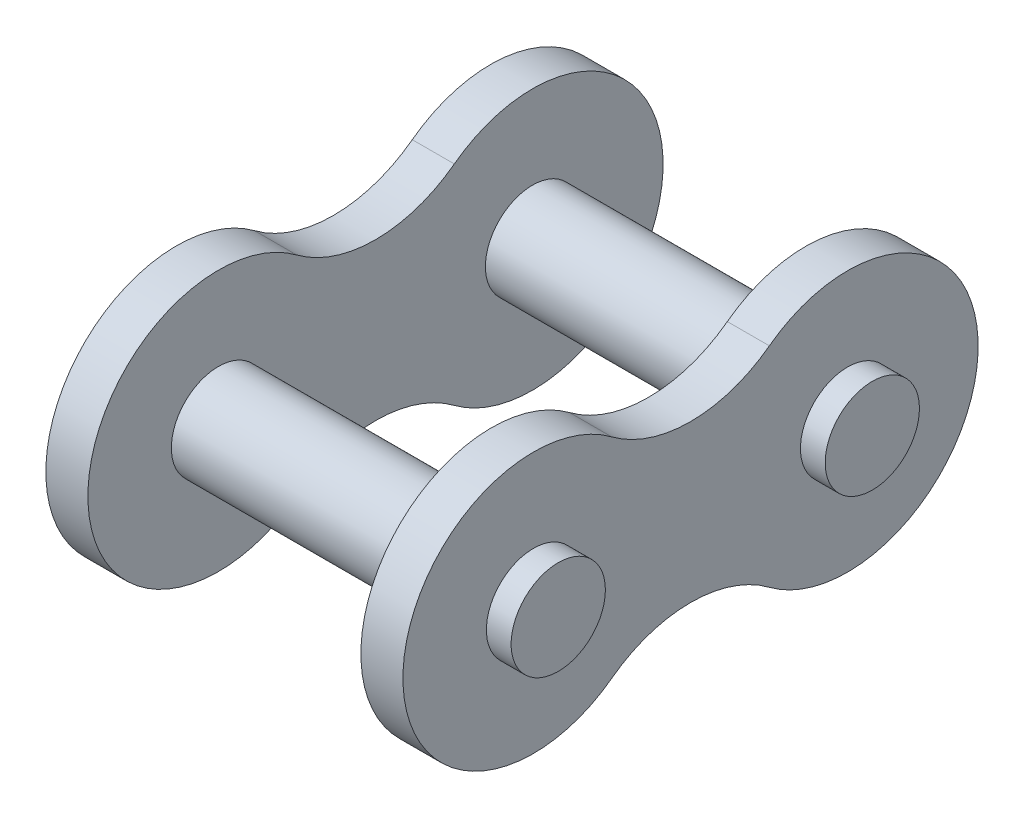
ISO-10303-21;
HEADER;
FILE_DESCRIPTION(('STEP AP214'),'2;1');
FILE_NAME('part.step','',(''),(''),'','','');
FILE_SCHEMA(('AUTOMOTIVE_DESIGN { 1 0 10303 214 1 1 1 1 }'));
ENDSEC;
DATA;
#1=APPLICATION_CONTEXT('core data for automotive mechanical design processes');
#2=APPLICATION_PROTOCOL_DEFINITION('international standard','automotive_design',2000,#1);
#3=PRODUCT_CONTEXT('',#1,'mechanical');
#4=PRODUCT('Part','Part','',(#3));
#5=PRODUCT_RELATED_PRODUCT_CATEGORY('part','',(#4));
#6=PRODUCT_DEFINITION_FORMATION('','',#4);
#7=PRODUCT_DEFINITION_CONTEXT('part definition',#1,'design');
#8=PRODUCT_DEFINITION('design','',#6,#7);
#9=PRODUCT_DEFINITION_SHAPE('','',#8);
#10=(LENGTH_UNIT() NAMED_UNIT(*) SI_UNIT(.MILLI.,.METRE.));
#11=(NAMED_UNIT(*) PLANE_ANGLE_UNIT() SI_UNIT($,.RADIAN.));
#12=(NAMED_UNIT(*) SI_UNIT($,.STERADIAN.) SOLID_ANGLE_UNIT());
#13=UNCERTAINTY_MEASURE_WITH_UNIT(LENGTH_MEASURE(1.E-05),#10,'distance_accuracy_value','');
#14=(GEOMETRIC_REPRESENTATION_CONTEXT(3) GLOBAL_UNCERTAINTY_ASSIGNED_CONTEXT((#13)) GLOBAL_UNIT_ASSIGNED_CONTEXT((#10,
#11,#12)) REPRESENTATION_CONTEXT('',''));
#15=CARTESIAN_POINT('',(0.,0.,0.));
#16=DIRECTION('',(0.,0.,1.));
#17=DIRECTION('',(1.,0.,0.));
#18=AXIS2_PLACEMENT_3D('',#15,#16,#17);
#19=CARTESIAN_POINT('',(-2.5,0.,0.));
#20=DIRECTION('',(1.,0.,0.));
#21=DIRECTION('',(0.,0.,-1.));
#22=AXIS2_PLACEMENT_3D('',#19,#20,#21);
#23=CYLINDRICAL_SURFACE('',#22,4.765);
#24=CARTESIAN_POINT('',(4.25,0.,0.));
#25=DIRECTION('',(1.,0.,0.));
#26=DIRECTION('',(0.,0.,-1.));
#27=AXIS2_PLACEMENT_3D('',#24,#25,#26);
#28=CIRCLE('',#27,4.765);
#29=CARTESIAN_POINT('',(4.25,0.,-4.765));
#30=VERTEX_POINT('',#29);
#31=EDGE_CURVE('E176',#30,#30,#28,.T.);
#32=ORIENTED_EDGE('',*,*,#31,.T.);
#33=EDGE_LOOP('',(#32));
#34=FACE_BOUND('',#33,.T.);
#35=CARTESIAN_POINT('',(31.85,0.,0.));
#36=DIRECTION('',(1.,0.,0.));
#37=DIRECTION('',(0.,0.,-1.));
#38=AXIS2_PLACEMENT_3D('',#35,#36,#37);
#39=CIRCLE('',#38,4.765);
#40=CARTESIAN_POINT('',(31.85,0.,-4.765));
#41=VERTEX_POINT('',#40);
#42=EDGE_CURVE('E155',#41,#41,#39,.F.);
#43=ORIENTED_EDGE('',*,*,#42,.T.);
#44=EDGE_LOOP('',(#43));
#45=FACE_BOUND('',#44,.T.);
#46=ADVANCED_FACE('F35',(#34,#45),#23,.T.);
#47=CARTESIAN_POINT('',(-2.5,0.,-31.75));
#48=DIRECTION('',(1.,0.,0.));
#49=DIRECTION('',(0.,0.,-1.));
#50=AXIS2_PLACEMENT_3D('',#47,#48,#49);
#51=CYLINDRICAL_SURFACE('',#50,4.765);
#52=CARTESIAN_POINT('',(4.25,0.,-31.75));
#53=DIRECTION('',(1.,0.,0.));
#54=DIRECTION('',(0.,0.,-1.));
#55=AXIS2_PLACEMENT_3D('',#52,#53,#54);
#56=CIRCLE('',#55,4.765);
#57=CARTESIAN_POINT('',(4.25,0.,-36.515));
#58=VERTEX_POINT('',#57);
#59=EDGE_CURVE('E179',#58,#58,#56,.T.);
#60=ORIENTED_EDGE('',*,*,#59,.T.);
#61=EDGE_LOOP('',(#60));
#62=FACE_BOUND('',#61,.T.);
#63=CARTESIAN_POINT('',(31.85,0.,-31.75));
#64=DIRECTION('',(1.,0.,0.));
#65=DIRECTION('',(0.,0.,-1.));
#66=AXIS2_PLACEMENT_3D('',#63,#64,#65);
#67=CIRCLE('',#66,4.765);
#68=CARTESIAN_POINT('',(31.85,0.,-36.515));
#69=VERTEX_POINT('',#68);
#70=EDGE_CURVE('E39',#69,#69,#67,.F.);
#71=ORIENTED_EDGE('',*,*,#70,.T.);
#72=EDGE_LOOP('',(#71));
#73=FACE_BOUND('',#72,.T.);
#74=ADVANCED_FACE('F214',(#62,#73),#51,.T.);
#75=CARTESIAN_POINT('',(4.25,10.6125580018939,-23.8125));
#76=DIRECTION('',(1.,0.,0.));
#77=DIRECTION('',(0.,0.,-1.));
#78=AXIS2_PLACEMENT_3D('',#75,#76,#77);
#79=PLANE('',#78);
#80=ORIENTED_EDGE('',*,*,#59,.F.);
#81=EDGE_LOOP('',(#80));
#82=FACE_BOUND('',#81,.T.);
#83=CARTESIAN_POINT('',(4.25,21.2251160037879,-15.875));
#84=DIRECTION('',(-1.,0.,0.));
#85=DIRECTION('',(0.,0.,-1.));
#86=AXIS2_PLACEMENT_3D('',#83,#84,#85);
#87=CIRCLE('',#86,13.3051160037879);
#88=CARTESIAN_POINT('',(4.25,10.5704699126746,-23.8439791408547));
#89=VERTEX_POINT('',#88);
#90=CARTESIAN_POINT('',(4.25,10.5704699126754,-7.90602085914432));
#91=VERTEX_POINT('',#90);
#92=EDGE_CURVE('E183',#89,#91,#87,.T.);
#93=ORIENTED_EDGE('',*,*,#92,.T.);
#94=CARTESIAN_POINT('',(4.25,0.,0.));
#95=DIRECTION('',(1.,0.,0.));
#96=DIRECTION('',(0.,0.,-1.));
#97=AXIS2_PLACEMENT_3D('',#94,#95,#96);
#98=CIRCLE('',#97,13.2);
#99=CARTESIAN_POINT('',(4.25,-10.570469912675,-7.90602085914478));
#100=VERTEX_POINT('',#99);
#101=EDGE_CURVE('E86',#91,#100,#98,.T.);
#102=ORIENTED_EDGE('',*,*,#101,.T.);
#103=CARTESIAN_POINT('',(4.25,-21.2251160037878,-15.875));
#104=DIRECTION('',(-1.,0.,0.));
#105=DIRECTION('',(0.,0.,-1.));
#106=AXIS2_PLACEMENT_3D('',#103,#104,#105);
#107=CIRCLE('',#106,13.3051160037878);
#108=CARTESIAN_POINT('',(4.25,-10.5704699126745,-23.8439791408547));
#109=VERTEX_POINT('',#108);
#110=EDGE_CURVE('E186',#100,#109,#107,.T.);
#111=ORIENTED_EDGE('',*,*,#110,.T.);
#112=CARTESIAN_POINT('',(4.25,0.,-31.75));
#113=DIRECTION('',(1.,0.,0.));
#114=DIRECTION('',(0.,0.,-1.));
#115=AXIS2_PLACEMENT_3D('',#112,#113,#114);
#116=CIRCLE('',#115,13.2);
#117=EDGE_CURVE('E54',#109,#89,#116,.T.);
#118=ORIENTED_EDGE('',*,*,#117,.T.);
#119=EDGE_LOOP('',(#93,#102,#111,#118));
#120=FACE_BOUND('',#119,.T.);
#121=ORIENTED_EDGE('',*,*,#31,.F.);
#122=EDGE_LOOP('',(#121));
#123=FACE_BOUND('',#122,.T.);
#124=ADVANCED_FACE('F235',(#82,#120,#123),#79,.T.);
#125=CARTESIAN_POINT('',(0.,10.6125580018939,-23.8125));
#126=DIRECTION('',(1.,0.,0.));
#127=DIRECTION('',(0.,0.,-1.));
#128=AXIS2_PLACEMENT_3D('',#125,#126,#127);
#129=PLANE('',#128);
#130=CARTESIAN_POINT('',(0.,0.,-31.75));
#131=DIRECTION('',(1.,0.,0.));
#132=DIRECTION('',(0.,0.,-1.));
#133=AXIS2_PLACEMENT_3D('',#130,#131,#132);
#134=CIRCLE('',#133,4.765);
#135=CARTESIAN_POINT('',(0.,0.,-36.515));
#136=VERTEX_POINT('',#135);
#137=EDGE_CURVE('E164',#136,#136,#134,.T.);
#138=ORIENTED_EDGE('',*,*,#137,.T.);
#139=EDGE_LOOP('',(#138));
#140=FACE_BOUND('',#139,.T.);
#141=CARTESIAN_POINT('',(0.,21.2251160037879,-15.875));
#142=DIRECTION('',(-1.,0.,0.));
#143=DIRECTION('',(0.,0.,-1.));
#144=AXIS2_PLACEMENT_3D('',#141,#142,#143);
#145=CIRCLE('',#144,13.3051160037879);
#146=CARTESIAN_POINT('',(0.,10.5704699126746,-23.8439791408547));
#147=VERTEX_POINT('',#146);
#148=CARTESIAN_POINT('',(0.,10.5704699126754,-7.90602085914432));
#149=VERTEX_POINT('',#148);
#150=EDGE_CURVE('E182',#147,#149,#145,.T.);
#151=ORIENTED_EDGE('',*,*,#150,.F.);
#152=CARTESIAN_POINT('',(0.,0.,-31.75));
#153=DIRECTION('',(1.,0.,0.));
#154=DIRECTION('',(0.,0.,-1.));
#155=AXIS2_PLACEMENT_3D('',#152,#153,#154);
#156=CIRCLE('',#155,13.2);
#157=CARTESIAN_POINT('',(0.,-10.5704699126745,-23.8439791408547));
#158=VERTEX_POINT('',#157);
#159=EDGE_CURVE('E78',#158,#147,#156,.T.);
#160=ORIENTED_EDGE('',*,*,#159,.F.);
#161=CARTESIAN_POINT('',(0.,-21.2251160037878,-15.875));
#162=DIRECTION('',(-1.,0.,0.));
#163=DIRECTION('',(0.,0.,-1.));
#164=AXIS2_PLACEMENT_3D('',#161,#162,#163);
#165=CIRCLE('',#164,13.3051160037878);
#166=CARTESIAN_POINT('',(0.,-10.570469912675,-7.90602085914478));
#167=VERTEX_POINT('',#166);
#168=EDGE_CURVE('E72',#167,#158,#165,.T.);
#169=ORIENTED_EDGE('',*,*,#168,.F.);
#170=CARTESIAN_POINT('',(0.,0.,0.));
#171=DIRECTION('',(1.,0.,0.));
#172=DIRECTION('',(0.,0.,-1.));
#173=AXIS2_PLACEMENT_3D('',#170,#171,#172);
#174=CIRCLE('',#173,13.2);
#175=EDGE_CURVE('E192',#149,#167,#174,.T.);
#176=ORIENTED_EDGE('',*,*,#175,.F.);
#177=EDGE_LOOP('',(#151,#160,#169,#176));
#178=FACE_BOUND('',#177,.T.);
#179=CARTESIAN_POINT('',(0.,0.,0.));
#180=DIRECTION('',(1.,0.,0.));
#181=DIRECTION('',(0.,0.,-1.));
#182=AXIS2_PLACEMENT_3D('',#179,#180,#181);
#183=CIRCLE('',#182,4.765);
#184=CARTESIAN_POINT('',(0.,0.,-4.765));
#185=VERTEX_POINT('',#184);
#186=EDGE_CURVE('E173',#185,#185,#183,.T.);
#187=ORIENTED_EDGE('',*,*,#186,.T.);
#188=EDGE_LOOP('',(#187));
#189=FACE_BOUND('',#188,.T.);
#190=ADVANCED_FACE('F268',(#140,#178,#189),#129,.F.);
#191=CARTESIAN_POINT('',(4.25,21.2251160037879,-15.875));
#192=DIRECTION('',(-1.,0.,0.));
#193=DIRECTION('',(0.,0.,1.));
#194=AXIS2_PLACEMENT_3D('',#191,#192,#193);
#195=CYLINDRICAL_SURFACE('',#194,13.3051160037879);
#196=ORIENTED_EDGE('',*,*,#150,.T.);
#197=DIRECTION('',(-1.,0.,0.));
#198=VECTOR('',#197,1.);
#199=CARTESIAN_POINT('',(4.25,10.5704699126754,-7.90602085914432));
#200=LINE('',#199,#198);
#201=EDGE_CURVE('E201',#91,#149,#200,.T.);
#202=ORIENTED_EDGE('',*,*,#201,.F.);
#203=ORIENTED_EDGE('',*,*,#92,.F.);
#204=DIRECTION('',(-1.,0.,0.));
#205=VECTOR('',#204,1.);
#206=CARTESIAN_POINT('',(4.25,10.5704699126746,-23.8439791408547));
#207=LINE('',#206,#205);
#208=EDGE_CURVE('E189',#89,#147,#207,.T.);
#209=ORIENTED_EDGE('',*,*,#208,.T.);
#210=EDGE_LOOP('',(#196,#202,#203,#209));
#211=FACE_BOUND('',#210,.T.);
#212=ADVANCED_FACE('F37',(#211),#195,.F.);
#213=CARTESIAN_POINT('',(4.25,0.,0.));
#214=DIRECTION('',(-1.,0.,0.));
#215=DIRECTION('',(0.,0.,1.));
#216=AXIS2_PLACEMENT_3D('',#213,#214,#215);
#217=CYLINDRICAL_SURFACE('',#216,13.2);
#218=ORIENTED_EDGE('',*,*,#175,.T.);
#219=DIRECTION('',(-1.,0.,0.));
#220=VECTOR('',#219,1.);
#221=CARTESIAN_POINT('',(4.25,-10.570469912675,-7.90602085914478));
#222=LINE('',#221,#220);
#223=EDGE_CURVE('E199',#100,#167,#222,.T.);
#224=ORIENTED_EDGE('',*,*,#223,.F.);
#225=ORIENTED_EDGE('',*,*,#101,.F.);
#226=ORIENTED_EDGE('',*,*,#201,.T.);
#227=EDGE_LOOP('',(#218,#224,#225,#226));
#228=FACE_BOUND('',#227,.T.);
#229=ADVANCED_FACE('F276',(#228),#217,.T.);
#230=CARTESIAN_POINT('',(4.25,-21.2251160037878,-15.875));
#231=DIRECTION('',(-1.,0.,0.));
#232=DIRECTION('',(0.,0.,1.));
#233=AXIS2_PLACEMENT_3D('',#230,#231,#232);
#234=CYLINDRICAL_SURFACE('',#233,13.3051160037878);
#235=ORIENTED_EDGE('',*,*,#168,.T.);
#236=DIRECTION('',(-1.,0.,0.));
#237=VECTOR('',#236,1.);
#238=CARTESIAN_POINT('',(4.25,-10.5704699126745,-23.8439791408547));
#239=LINE('',#238,#237);
#240=EDGE_CURVE('E197',#109,#158,#239,.T.);
#241=ORIENTED_EDGE('',*,*,#240,.F.);
#242=ORIENTED_EDGE('',*,*,#110,.F.);
#243=ORIENTED_EDGE('',*,*,#223,.T.);
#244=EDGE_LOOP('',(#235,#241,#242,#243));
#245=FACE_BOUND('',#244,.T.);
#246=ADVANCED_FACE('F262',(#245),#234,.F.);
#247=CARTESIAN_POINT('',(4.25,0.,-31.75));
#248=DIRECTION('',(-1.,0.,0.));
#249=DIRECTION('',(0.,0.,1.));
#250=AXIS2_PLACEMENT_3D('',#247,#248,#249);
#251=CYLINDRICAL_SURFACE('',#250,13.2);
#252=ORIENTED_EDGE('',*,*,#159,.T.);
#253=ORIENTED_EDGE('',*,*,#208,.F.);
#254=ORIENTED_EDGE('',*,*,#117,.F.);
#255=ORIENTED_EDGE('',*,*,#240,.T.);
#256=EDGE_LOOP('',(#252,#253,#254,#255));
#257=FACE_BOUND('',#256,.T.);
#258=ADVANCED_FACE('F257',(#257),#251,.T.);
#259=CARTESIAN_POINT('',(-2.5,0.,0.));
#260=DIRECTION('',(1.,0.,0.));
#261=DIRECTION('',(0.,0.,-1.));
#262=AXIS2_PLACEMENT_3D('',#259,#260,#261);
#263=PLANE('',#262);
#264=CARTESIAN_POINT('',(-2.5,0.,0.));
#265=DIRECTION('',(1.,0.,0.));
#266=DIRECTION('',(0.,0.,-1.));
#267=AXIS2_PLACEMENT_3D('',#264,#265,#266);
#268=CIRCLE('',#267,4.765);
#269=CARTESIAN_POINT('',(-2.5,0.,-4.765));
#270=VERTEX_POINT('',#269);
#271=EDGE_CURVE('E170',#270,#270,#268,.T.);
#272=ORIENTED_EDGE('',*,*,#271,.F.);
#273=EDGE_LOOP('',(#272));
#274=FACE_BOUND('',#273,.T.);
#275=ADVANCED_FACE('F242',(#274),#263,.F.);
#276=ORIENTED_EDGE('',*,*,#271,.T.);
#277=EDGE_LOOP('',(#276));
#278=FACE_BOUND('',#277,.T.);
#279=ORIENTED_EDGE('',*,*,#186,.F.);
#280=EDGE_LOOP('',(#279));
#281=FACE_BOUND('',#280,.T.);
#282=ADVANCED_FACE('F230',(#278,#281),#23,.T.);
#283=CARTESIAN_POINT('',(-2.5,0.,-31.75));
#284=DIRECTION('',(1.,0.,0.));
#285=DIRECTION('',(0.,0.,-1.));
#286=AXIS2_PLACEMENT_3D('',#283,#284,#285);
#287=PLANE('',#286);
#288=CARTESIAN_POINT('',(-2.5,0.,-31.75));
#289=DIRECTION('',(1.,0.,0.));
#290=DIRECTION('',(0.,0.,-1.));
#291=AXIS2_PLACEMENT_3D('',#288,#289,#290);
#292=CIRCLE('',#291,4.765);
#293=CARTESIAN_POINT('',(-2.5,0.,-36.515));
#294=VERTEX_POINT('',#293);
#295=EDGE_CURVE('E161',#294,#294,#292,.T.);
#296=ORIENTED_EDGE('',*,*,#295,.F.);
#297=EDGE_LOOP('',(#296));
#298=FACE_BOUND('',#297,.T.);
#299=ADVANCED_FACE('F241',(#298),#287,.F.);
#300=ORIENTED_EDGE('',*,*,#295,.T.);
#301=EDGE_LOOP('',(#300));
#302=FACE_BOUND('',#301,.T.);
#303=ORIENTED_EDGE('',*,*,#137,.F.);
#304=EDGE_LOOP('',(#303));
#305=FACE_BOUND('',#304,.T.);
#306=ADVANCED_FACE('F215',(#302,#305),#51,.T.);
#307=CARTESIAN_POINT('',(31.85,0.,-31.75));
#308=DIRECTION('',(1.,0.,0.));
#309=DIRECTION('',(0.,0.,-1.));
#310=AXIS2_PLACEMENT_3D('',#307,#308,#309);
#311=CYLINDRICAL_SURFACE('',#310,13.2);
#312=CARTESIAN_POINT('',(36.1,0.,-31.75));
#313=DIRECTION('',(1.,0.,0.));
#314=DIRECTION('',(0.,0.,-1.));
#315=AXIS2_PLACEMENT_3D('',#312,#313,#314);
#316=CIRCLE('',#315,13.2);
#317=CARTESIAN_POINT('',(36.1,-10.5704699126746,-23.8439791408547));
#318=VERTEX_POINT('',#317);
#319=CARTESIAN_POINT('',(36.1,10.5704699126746,-23.8439791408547));
#320=VERTEX_POINT('',#319);
#321=EDGE_CURVE('E146',#318,#320,#316,.T.);
#322=ORIENTED_EDGE('',*,*,#321,.F.);
#323=DIRECTION('',(1.,0.,0.));
#324=VECTOR('',#323,1.);
#325=CARTESIAN_POINT('',(31.85,-10.5704699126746,-23.8439791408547));
#326=LINE('',#325,#324);
#327=CARTESIAN_POINT('',(31.85,-10.5704699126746,-23.8439791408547));
#328=VERTEX_POINT('',#327);
#329=EDGE_CURVE('E137',#328,#318,#326,.T.);
#330=ORIENTED_EDGE('',*,*,#329,.F.);
#331=CARTESIAN_POINT('',(31.85,0.,-31.75));
#332=DIRECTION('',(1.,0.,0.));
#333=DIRECTION('',(0.,0.,-1.));
#334=AXIS2_PLACEMENT_3D('',#331,#332,#333);
#335=CIRCLE('',#334,13.2);
#336=CARTESIAN_POINT('',(31.85,10.5704699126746,-23.8439791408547));
#337=VERTEX_POINT('',#336);
#338=EDGE_CURVE('E131',#328,#337,#335,.T.);
#339=ORIENTED_EDGE('',*,*,#338,.T.);
#340=DIRECTION('',(1.,0.,0.));
#341=VECTOR('',#340,1.);
#342=CARTESIAN_POINT('',(31.85,10.5704699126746,-23.8439791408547));
#343=LINE('',#342,#341);
#344=EDGE_CURVE('E113',#337,#320,#343,.T.);
#345=ORIENTED_EDGE('',*,*,#344,.T.);
#346=EDGE_LOOP('',(#322,#330,#339,#345));
#347=FACE_BOUND('',#346,.T.);
#348=ADVANCED_FACE('F136',(#347),#311,.T.);
#349=CARTESIAN_POINT('',(31.85,-21.2251160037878,-15.875));
#350=DIRECTION('',(1.,0.,0.));
#351=DIRECTION('',(0.,0.,-1.));
#352=AXIS2_PLACEMENT_3D('',#349,#350,#351);
#353=CYLINDRICAL_SURFACE('',#352,13.3051160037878);
#354=CARTESIAN_POINT('',(36.1,-21.2251160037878,-15.875));
#355=DIRECTION('',(-1.,0.,0.));
#356=DIRECTION('',(0.,0.,-1.));
#357=AXIS2_PLACEMENT_3D('',#354,#355,#356);
#358=CIRCLE('',#357,13.3051160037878);
#359=CARTESIAN_POINT('',(36.1,-10.570469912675,-7.90602085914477));
#360=VERTEX_POINT('',#359);
#361=EDGE_CURVE('E138',#360,#318,#358,.T.);
#362=ORIENTED_EDGE('',*,*,#361,.F.);
#363=DIRECTION('',(1.,0.,0.));
#364=VECTOR('',#363,1.);
#365=CARTESIAN_POINT('',(31.85,-10.570469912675,-7.90602085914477));
#366=LINE('',#365,#364);
#367=CARTESIAN_POINT('',(31.85,-10.570469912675,-7.90602085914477));
#368=VERTEX_POINT('',#367);
#369=EDGE_CURVE('E152',#368,#360,#366,.T.);
#370=ORIENTED_EDGE('',*,*,#369,.F.);
#371=CARTESIAN_POINT('',(31.85,-21.2251160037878,-15.875));
#372=DIRECTION('',(-1.,0.,0.));
#373=DIRECTION('',(0.,0.,-1.));
#374=AXIS2_PLACEMENT_3D('',#371,#372,#373);
#375=CIRCLE('',#374,13.3051160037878);
#376=EDGE_CURVE('E124',#368,#328,#375,.T.);
#377=ORIENTED_EDGE('',*,*,#376,.T.);
#378=ORIENTED_EDGE('',*,*,#329,.T.);
#379=EDGE_LOOP('',(#362,#370,#377,#378));
#380=FACE_BOUND('',#379,.T.);
#381=ADVANCED_FACE('F356',(#380),#353,.F.);
#382=CARTESIAN_POINT('',(31.85,0.,0.));
#383=DIRECTION('',(1.,0.,0.));
#384=DIRECTION('',(0.,0.,-1.));
#385=AXIS2_PLACEMENT_3D('',#382,#383,#384);
#386=CYLINDRICAL_SURFACE('',#385,13.2);
#387=CARTESIAN_POINT('',(36.1,0.,0.));
#388=DIRECTION('',(1.,0.,0.));
#389=DIRECTION('',(0.,0.,-1.));
#390=AXIS2_PLACEMENT_3D('',#387,#388,#389);
#391=CIRCLE('',#390,13.2);
#392=CARTESIAN_POINT('',(36.1,10.5704699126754,-7.90602085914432));
#393=VERTEX_POINT('',#392);
#394=EDGE_CURVE('E141',#393,#360,#391,.T.);
#395=ORIENTED_EDGE('',*,*,#394,.F.);
#396=DIRECTION('',(1.,0.,0.));
#397=VECTOR('',#396,1.);
#398=CARTESIAN_POINT('',(31.85,10.5704699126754,-7.90602085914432));
#399=LINE('',#398,#397);
#400=CARTESIAN_POINT('',(31.85,10.5704699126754,-7.90602085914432));
#401=VERTEX_POINT('',#400);
#402=EDGE_CURVE('E123',#401,#393,#399,.T.);
#403=ORIENTED_EDGE('',*,*,#402,.F.);
#404=CARTESIAN_POINT('',(31.85,0.,0.));
#405=DIRECTION('',(1.,0.,0.));
#406=DIRECTION('',(0.,0.,-1.));
#407=AXIS2_PLACEMENT_3D('',#404,#405,#406);
#408=CIRCLE('',#407,13.2);
#409=EDGE_CURVE('E134',#401,#368,#408,.T.);
#410=ORIENTED_EDGE('',*,*,#409,.T.);
#411=ORIENTED_EDGE('',*,*,#369,.T.);
#412=EDGE_LOOP('',(#395,#403,#410,#411));
#413=FACE_BOUND('',#412,.T.);
#414=ADVANCED_FACE('F364',(#413),#386,.T.);
#415=CARTESIAN_POINT('',(31.85,21.2251160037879,-15.875));
#416=DIRECTION('',(1.,0.,0.));
#417=DIRECTION('',(0.,0.,-1.));
#418=AXIS2_PLACEMENT_3D('',#415,#416,#417);
#419=CYLINDRICAL_SURFACE('',#418,13.3051160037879);
#420=CARTESIAN_POINT('',(36.1,21.2251160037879,-15.875));
#421=DIRECTION('',(-1.,0.,0.));
#422=DIRECTION('',(0.,0.,-1.));
#423=AXIS2_PLACEMENT_3D('',#420,#421,#422);
#424=CIRCLE('',#423,13.3051160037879);
#425=EDGE_CURVE('E118',#320,#393,#424,.T.);
#426=ORIENTED_EDGE('',*,*,#425,.F.);
#427=ORIENTED_EDGE('',*,*,#344,.F.);
#428=CARTESIAN_POINT('',(31.85,21.2251160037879,-15.875));
#429=DIRECTION('',(-1.,0.,0.));
#430=DIRECTION('',(0.,0.,-1.));
#431=AXIS2_PLACEMENT_3D('',#428,#429,#430);
#432=CIRCLE('',#431,13.3051160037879);
#433=EDGE_CURVE('E116',#337,#401,#432,.T.);
#434=ORIENTED_EDGE('',*,*,#433,.T.);
#435=ORIENTED_EDGE('',*,*,#402,.T.);
#436=EDGE_LOOP('',(#426,#427,#434,#435));
#437=FACE_BOUND('',#436,.T.);
#438=ADVANCED_FACE('F115',(#437),#419,.F.);
#439=CARTESIAN_POINT('',(31.85,10.6125580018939,-23.8125));
#440=DIRECTION('',(1.,0.,0.));
#441=DIRECTION('',(0.,0.,-1.));
#442=AXIS2_PLACEMENT_3D('',#439,#440,#441);
#443=PLANE('',#442);
#444=ORIENTED_EDGE('',*,*,#42,.F.);
#445=EDGE_LOOP('',(#444));
#446=FACE_BOUND('',#445,.T.);
#447=ORIENTED_EDGE('',*,*,#70,.F.);
#448=EDGE_LOOP('',(#447));
#449=FACE_BOUND('',#448,.T.);
#450=ORIENTED_EDGE('',*,*,#338,.F.);
#451=ORIENTED_EDGE('',*,*,#376,.F.);
#452=ORIENTED_EDGE('',*,*,#409,.F.);
#453=ORIENTED_EDGE('',*,*,#433,.F.);
#454=EDGE_LOOP('',(#450,#451,#452,#453));
#455=FACE_BOUND('',#454,.T.);
#456=ADVANCED_FACE('F129',(#446,#449,#455),#443,.F.);
#457=CARTESIAN_POINT('',(36.1,10.6125580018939,-23.8125));
#458=DIRECTION('',(1.,0.,0.));
#459=DIRECTION('',(0.,0.,-1.));
#460=AXIS2_PLACEMENT_3D('',#457,#458,#459);
#461=PLANE('',#460);
#462=CARTESIAN_POINT('',(36.1,0.,0.));
#463=DIRECTION('',(1.,0.,0.));
#464=DIRECTION('',(0.,0.,-1.));
#465=AXIS2_PLACEMENT_3D('',#462,#463,#464);
#466=CIRCLE('',#465,4.765);
#467=CARTESIAN_POINT('',(36.1,0.,-4.765));
#468=VERTEX_POINT('',#467);
#469=EDGE_CURVE('E11',#468,#468,#466,.F.);
#470=ORIENTED_EDGE('',*,*,#469,.T.);
#471=EDGE_LOOP('',(#470));
#472=FACE_BOUND('',#471,.T.);
#473=CARTESIAN_POINT('',(36.1,0.,-31.75));
#474=DIRECTION('',(1.,0.,0.));
#475=DIRECTION('',(0.,0.,-1.));
#476=AXIS2_PLACEMENT_3D('',#473,#474,#475);
#477=CIRCLE('',#476,4.765);
#478=CARTESIAN_POINT('',(36.1,0.,-36.515));
#479=VERTEX_POINT('',#478);
#480=EDGE_CURVE('E45',#479,#479,#477,.F.);
#481=ORIENTED_EDGE('',*,*,#480,.T.);
#482=EDGE_LOOP('',(#481));
#483=FACE_BOUND('',#482,.T.);
#484=ORIENTED_EDGE('',*,*,#321,.T.);
#485=ORIENTED_EDGE('',*,*,#425,.T.);
#486=ORIENTED_EDGE('',*,*,#394,.T.);
#487=ORIENTED_EDGE('',*,*,#361,.T.);
#488=EDGE_LOOP('',(#484,#485,#486,#487));
#489=FACE_BOUND('',#488,.T.);
#490=ADVANCED_FACE('F205',(#472,#483,#489),#461,.T.);
#491=CARTESIAN_POINT('',(38.6,0.,-31.75));
#492=DIRECTION('',(1.,0.,0.));
#493=DIRECTION('',(0.,0.,-1.));
#494=AXIS2_PLACEMENT_3D('',#491,#492,#493);
#495=PLANE('',#494);
#496=CARTESIAN_POINT('',(38.6,0.,-31.75));
#497=DIRECTION('',(1.,0.,0.));
#498=DIRECTION('',(0.,0.,-1.));
#499=AXIS2_PLACEMENT_3D('',#496,#497,#498);
#500=CIRCLE('',#499,4.765);
#501=CARTESIAN_POINT('',(38.6,0.,-36.515));
#502=VERTEX_POINT('',#501);
#503=EDGE_CURVE('E158',#502,#502,#500,.T.);
#504=ORIENTED_EDGE('',*,*,#503,.T.);
#505=EDGE_LOOP('',(#504));
#506=FACE_BOUND('',#505,.T.);
#507=ADVANCED_FACE('F212',(#506),#495,.T.);
#508=ORIENTED_EDGE('',*,*,#480,.F.);
#509=EDGE_LOOP('',(#508));
#510=FACE_BOUND('',#509,.T.);
#511=ORIENTED_EDGE('',*,*,#503,.F.);
#512=EDGE_LOOP('',(#511));
#513=FACE_BOUND('',#512,.T.);
#514=ADVANCED_FACE('F208',(#510,#513),#51,.T.);
#515=CARTESIAN_POINT('',(38.6,0.,0.));
#516=DIRECTION('',(1.,0.,0.));
#517=DIRECTION('',(0.,0.,-1.));
#518=AXIS2_PLACEMENT_3D('',#515,#516,#517);
#519=PLANE('',#518);
#520=CARTESIAN_POINT('',(38.6,0.,0.));
#521=DIRECTION('',(1.,0.,0.));
#522=DIRECTION('',(0.,0.,-1.));
#523=AXIS2_PLACEMENT_3D('',#520,#521,#522);
#524=CIRCLE('',#523,4.765);
#525=CARTESIAN_POINT('',(38.6,0.,-4.765));
#526=VERTEX_POINT('',#525);
#527=EDGE_CURVE('E167',#526,#526,#524,.T.);
#528=ORIENTED_EDGE('',*,*,#527,.T.);
#529=EDGE_LOOP('',(#528));
#530=FACE_BOUND('',#529,.T.);
#531=ADVANCED_FACE('F211',(#530),#519,.T.);
#532=ORIENTED_EDGE('',*,*,#469,.F.);
#533=EDGE_LOOP('',(#532));
#534=FACE_BOUND('',#533,.T.);
#535=ORIENTED_EDGE('',*,*,#527,.F.);
#536=EDGE_LOOP('',(#535));
#537=FACE_BOUND('',#536,.T.);
#538=ADVANCED_FACE('F231',(#534,#537),#23,.T.);
#539=CLOSED_SHELL('',(#46,#74,#124,#190,#212,#229,#246,#258,#275,#282,#299,#306,#348,#381,#414,
#438,#456,#490,#507,#514,#531,#538));
#540=MANIFOLD_SOLID_BREP('B2',#539);
#541=ADVANCED_BREP_SHAPE_REPRESENTATION('',(#18,#540),#14);
#542=SHAPE_DEFINITION_REPRESENTATION(#9,#541);
ENDSEC;
END-ISO-10303-21;
